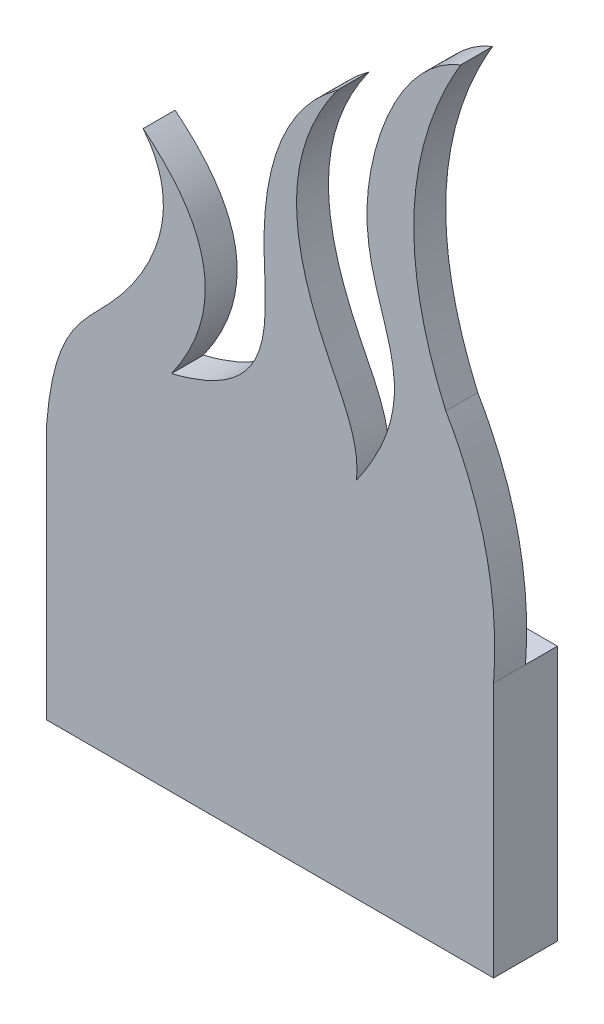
from build123d import *

# Parameters (mm, degrees)
SKETCH1_W           = 44.45
SKETCH1_H           = 6.35
BOSS_EXTRUDE1_DEPTH = 25.4
BOSS_EXTRUDE3_DEPTH = 3.175


with BuildPart() as part:
    # Sketch1 → Boss-Extrude1 (new body)
    with BuildSketch(Plane(origin=(0, 0, 0), x_dir=(1, 0, 0), z_dir=(0, 1, 0))):
        Rectangle(SKETCH1_W, SKETCH1_H)
    extrude(amount=BOSS_EXTRUDE1_DEPTH)

    # Sketch2 → Boss-Extrude3 (add)
    with BuildSketch(Plane.XY.offset(3.175)):
        with BuildLine():
            Line((-22.225, 25.4), (22.225, 25.4))
            add(Edge.make_bspline(
                [(22.225, 25.4), (23.080075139, 36.826719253), (17.47381132, 46.448083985)],
                knots=[0, 0, 0, 1, 1, 1], degree=2))
            add(Edge.make_bspline(
                [(18.960709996, 76.999017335), (10.436728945, 62.599145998), (17.47381132, 46.448083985)],
                knots=[0, 0, 0, 1, 1, 1], degree=2))
            add(Edge.make_bspline(
                [(8.593671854, 36.037422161), (16.531046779, 47.420358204), (4.885916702, 52.421199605), (12.90140309, 74.624108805), (18.960709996, 76.999017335)],
                knots=[0, 0, 0, 0, 0.608339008, 1, 1, 1, 1], degree=3))
            add(Edge.make_bspline(
                [(6.677599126, 68.674527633), (0.789934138, 60.467070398), (2.717549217, 49.618429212), (8.977110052, 39.508942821), (8.593671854, 36.037422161)],
                knots=[0, 0, 0, 0, 0.69804024, 1, 1, 1, 1], degree=3))
            add(Edge.make_bspline(
                [(-9.800626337, 36.037422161), (1.344348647, 38.77987015), (-2.46619862, 51.726212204), (1.177845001, 64.698670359), (6.677599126, 68.674527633)],
                knots=[0, 0, 0, 0, 0.510492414, 1, 1, 1, 1], degree=3))
            add(Edge.make_bspline(
                [(-12.619937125, 55.722809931), (-1.898741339, 47.177008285), (-9.800626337, 36.037422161)],
                knots=[0, 0, 0, 1, 1, 1], degree=2))
            add(Edge.make_bspline(
                [(-22.225, 25.4), (-21.464286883, 34.864300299), (-15.305850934, 37.379836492), (-8.245924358, 50.329924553), (-12.619937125, 55.722809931)],
                knots=[0, 0, 0, 0, 0.483876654, 1, 1, 1, 1], degree=3))
        make_face()
    extrude(amount=-BOSS_EXTRUDE3_DEPTH)


solid = part.part
